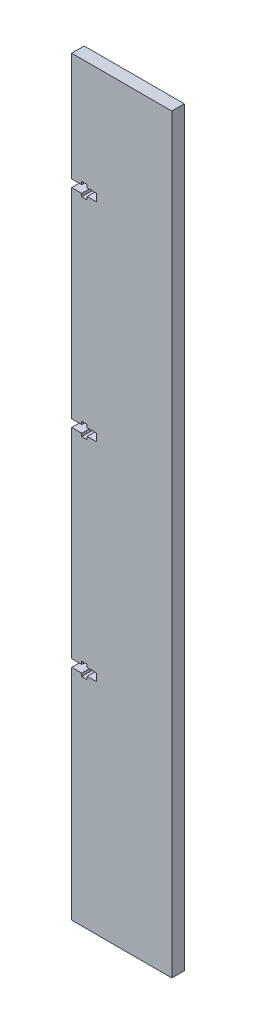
from build123d import *

# Parameters (mm, degrees)
SKETCH1_W           = 40
SKETCH1_H           = 300
BOSS_EXTRUDE1_DEPTH = 5
CUT_EXTRUDE1_DEPTH  = 10


with BuildPart() as part:
    # Sketch1 → Boss-Extrude1 (new body)
    with BuildSketch(Plane.XY):
        Rectangle(SKETCH1_W, SKETCH1_H)
    extrude(amount=BOSS_EXTRUDE1_DEPTH)

    # Sketch2 → Cut-Extrude1 (cut)
    with BuildSketch(Plane(origin=(0, 0, 0), x_dir=(-1, 0, 0), z_dir=(0, 0, -1))):
        Polygon((20, -62.5), (20, -59.5), (16, -59.5), (16, -58.35), (13.8, -58.35), (13.8, -59.5), (10, -59.5), (10, -61), (10, -62.5), (13.8, -62.5), (13.8, -63.65), (16, -63.65), (16, -62.5), align=None)
        Polygon((16, 20.5), (20, 20.5), (20, 23.5), (16, 23.5), (16, 24.65), (13.8, 24.65), (13.8, 23.5), (10, 23.5), (10, 20.5), (13.8, 20.5), (13.8, 19.35), (16, 19.35), align=None)
        Polygon((16, 103.5), (20, 103.5), (20, 105), (20, 106.5), (16, 106.5), (16, 107.65), (13.8, 107.65), (13.8, 106.5), (10, 106.5), (10, 103.5), (13.8, 103.5), (13.8, 102.35), (16, 102.35), align=None)
    extrude(amount=-CUT_EXTRUDE1_DEPTH, mode=Mode.SUBTRACT)


solid = part.part
